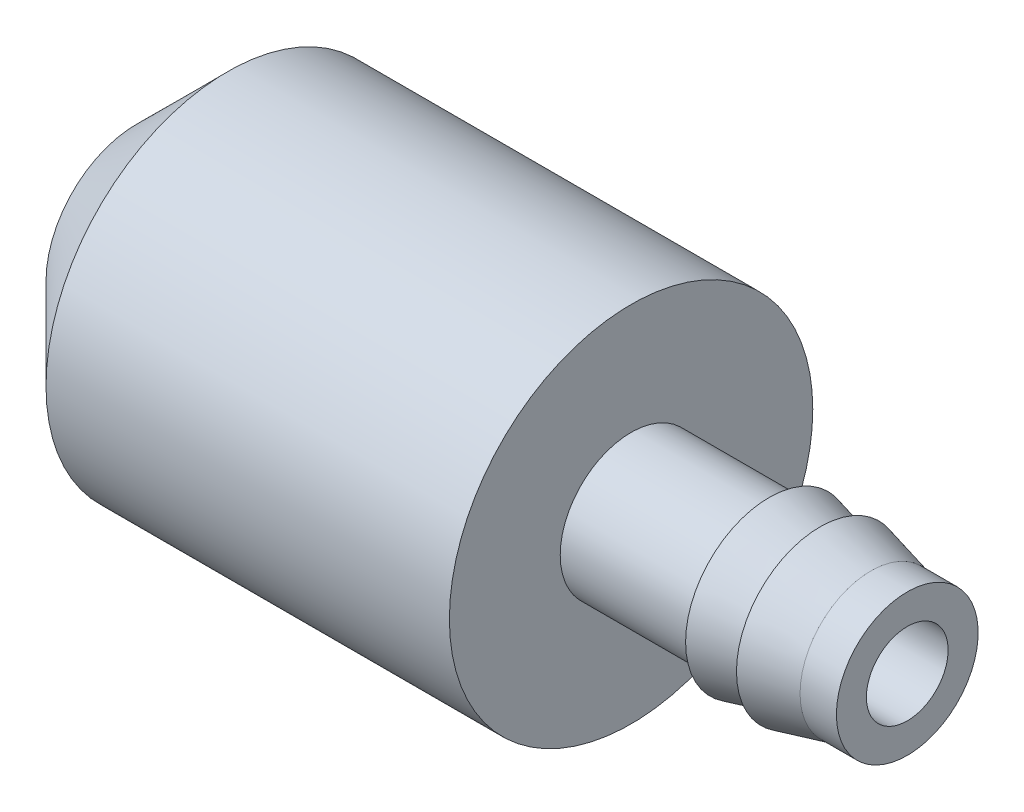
from build123d import *


with BuildPart() as part:
    # Esquisse1 → R_volution1 (revolve)
    with BuildSketch(Plane.XY, mode=Mode.PRIVATE) as r_volution1_sk:
        Polygon((0, 1.125), (0, 2.5), (2.5, 5), (13.6, 5), (13.6, 1.95), (17.4, 1.95), (17.4, 2.3), (18.8, 1.95), (18.8, 2.3), (20.2, 1.95), (21.2, 1.95), (21.2, 1.125), align=None)
    revolve(r_volution1_sk.sketch.rotate(Axis((0, 0, 0), (1, 0, 0)), 90), axis=Axis((0, 0, 0), (1, 0, 0)))


solid = part.part
